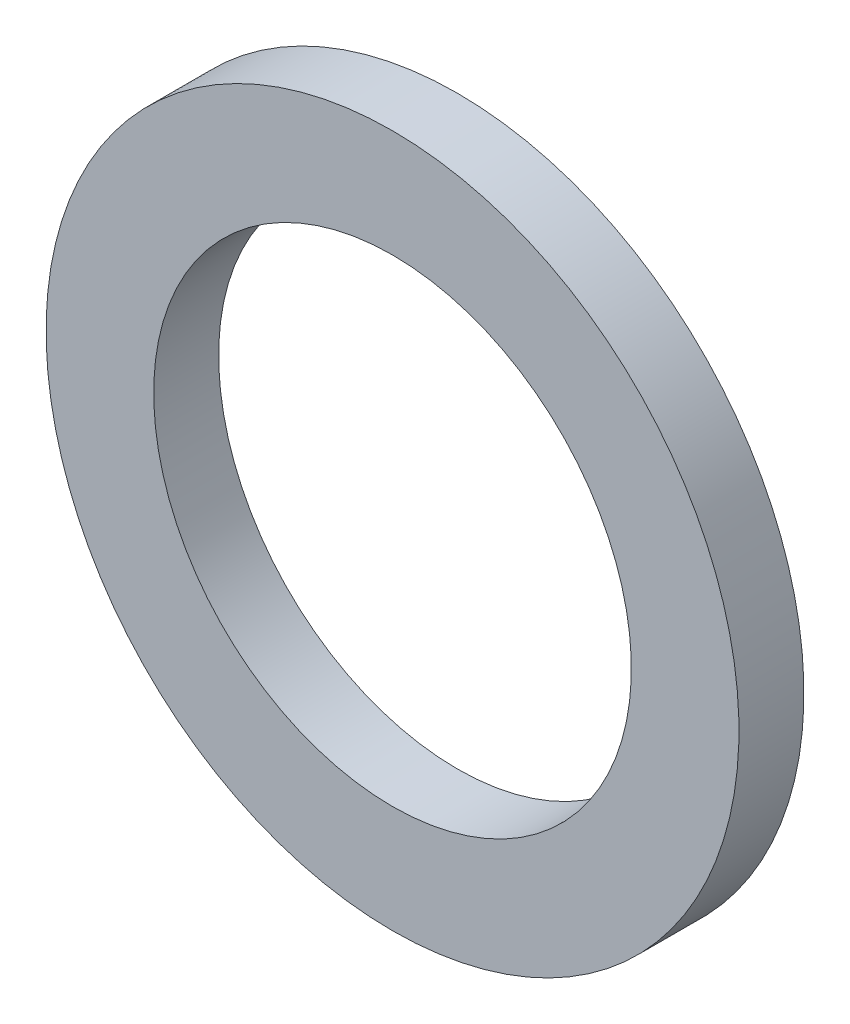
ISO-10303-21;
HEADER;
FILE_DESCRIPTION(('STEP AP214'),'2;1');
FILE_NAME('part.step','',(''),(''),'','','');
FILE_SCHEMA(('AUTOMOTIVE_DESIGN { 1 0 10303 214 1 1 1 1 }'));
ENDSEC;
DATA;
#1=APPLICATION_CONTEXT('core data for automotive mechanical design processes');
#2=APPLICATION_PROTOCOL_DEFINITION('international standard','automotive_design',2000,#1);
#3=PRODUCT_CONTEXT('',#1,'mechanical');
#4=PRODUCT('Part','Part','',(#3));
#5=PRODUCT_RELATED_PRODUCT_CATEGORY('part','',(#4));
#6=PRODUCT_DEFINITION_FORMATION('','',#4);
#7=PRODUCT_DEFINITION_CONTEXT('part definition',#1,'design');
#8=PRODUCT_DEFINITION('design','',#6,#7);
#9=PRODUCT_DEFINITION_SHAPE('','',#8);
#10=(LENGTH_UNIT() NAMED_UNIT(*) SI_UNIT(.MILLI.,.METRE.));
#11=(NAMED_UNIT(*) PLANE_ANGLE_UNIT() SI_UNIT($,.RADIAN.));
#12=(NAMED_UNIT(*) SI_UNIT($,.STERADIAN.) SOLID_ANGLE_UNIT());
#13=UNCERTAINTY_MEASURE_WITH_UNIT(LENGTH_MEASURE(1.E-05),#10,'distance_accuracy_value','');
#14=(GEOMETRIC_REPRESENTATION_CONTEXT(3) GLOBAL_UNCERTAINTY_ASSIGNED_CONTEXT((#13)) GLOBAL_UNIT_ASSIGNED_CONTEXT((#10,
#11,#12)) REPRESENTATION_CONTEXT('',''));
#15=CARTESIAN_POINT('',(0.,0.,0.));
#16=DIRECTION('',(0.,0.,1.));
#17=DIRECTION('',(1.,0.,0.));
#18=AXIS2_PLACEMENT_3D('',#15,#16,#17);
#19=CARTESIAN_POINT('',(-45.2,-12.13655,26.625));
#20=DIRECTION('',(0.,0.,1.));
#21=DIRECTION('',(0.,-1.,0.));
#22=AXIS2_PLACEMENT_3D('',#19,#20,#21);
#23=PLANE('',#22);
#24=CARTESIAN_POINT('',(-45.2,-8.,26.625));
#25=DIRECTION('',(0.,0.,1.));
#26=DIRECTION('',(0.,-1.,0.));
#27=AXIS2_PLACEMENT_3D('',#24,#25,#26);
#28=CIRCLE('',#27,4.13655);
#29=CARTESIAN_POINT('',(-45.2,-12.13655,26.625));
#30=VERTEX_POINT('',#29);
#31=EDGE_CURVE('E27',#30,#30,#28,.F.);
#32=ORIENTED_EDGE('',*,*,#31,.T.);
#33=EDGE_LOOP('',(#32));
#34=FACE_BOUND('',#33,.T.);
#35=CARTESIAN_POINT('',(-45.2,-8.,26.625));
#36=DIRECTION('',(0.,0.,1.));
#37=DIRECTION('',(0.,-1.,0.));
#38=AXIS2_PLACEMENT_3D('',#35,#36,#37);
#39=CIRCLE('',#38,6.);
#40=CARTESIAN_POINT('',(-45.2,-14.,26.625));
#41=VERTEX_POINT('',#40);
#42=EDGE_CURVE('E18',#41,#41,#39,.F.);
#43=ORIENTED_EDGE('',*,*,#42,.F.);
#44=EDGE_LOOP('',(#43));
#45=FACE_BOUND('',#44,.T.);
#46=ADVANCED_FACE('F15',(#34,#45),#23,.T.);
#47=CARTESIAN_POINT('',(-45.2,-8.,30.));
#48=DIRECTION('',(0.,0.,1.));
#49=DIRECTION('',(0.,-1.,0.));
#50=AXIS2_PLACEMENT_3D('',#47,#48,#49);
#51=CYLINDRICAL_SURFACE('',#50,6.);
#52=ORIENTED_EDGE('',*,*,#42,.T.);
#53=EDGE_LOOP('',(#52));
#54=FACE_BOUND('',#53,.T.);
#55=CARTESIAN_POINT('',(-45.2,-8.,25.5));
#56=DIRECTION('',(0.,0.,1.));
#57=DIRECTION('',(0.,-1.,0.));
#58=AXIS2_PLACEMENT_3D('',#55,#56,#57);
#59=CIRCLE('',#58,6.);
#60=CARTESIAN_POINT('',(-45.2,-14.,25.5));
#61=VERTEX_POINT('',#60);
#62=EDGE_CURVE('E22',#61,#61,#59,.F.);
#63=ORIENTED_EDGE('',*,*,#62,.F.);
#64=EDGE_LOOP('',(#63));
#65=FACE_BOUND('',#64,.T.);
#66=ADVANCED_FACE('F35',(#54,#65),#51,.T.);
#67=CARTESIAN_POINT('',(-45.2,-8.,30.));
#68=DIRECTION('',(0.,0.,1.));
#69=DIRECTION('',(0.,-1.,0.));
#70=AXIS2_PLACEMENT_3D('',#67,#68,#69);
#71=CYLINDRICAL_SURFACE('',#70,4.13655);
#72=CARTESIAN_POINT('',(-45.2,-8.,25.5));
#73=DIRECTION('',(0.,0.,1.));
#74=DIRECTION('',(0.,-1.,0.));
#75=AXIS2_PLACEMENT_3D('',#72,#73,#74);
#76=CIRCLE('',#75,4.13655);
#77=CARTESIAN_POINT('',(-45.2,-12.13655,25.5));
#78=VERTEX_POINT('',#77);
#79=EDGE_CURVE('E10',#78,#78,#76,.T.);
#80=ORIENTED_EDGE('',*,*,#79,.F.);
#81=EDGE_LOOP('',(#80));
#82=FACE_BOUND('',#81,.T.);
#83=ORIENTED_EDGE('',*,*,#31,.F.);
#84=EDGE_LOOP('',(#83));
#85=FACE_BOUND('',#84,.T.);
#86=ADVANCED_FACE('F43',(#82,#85),#71,.F.);
#87=CARTESIAN_POINT('',(-45.2,-14.,25.5));
#88=DIRECTION('',(0.,0.,-1.));
#89=DIRECTION('',(0.,1.,0.));
#90=AXIS2_PLACEMENT_3D('',#87,#88,#89);
#91=PLANE('',#90);
#92=ORIENTED_EDGE('',*,*,#79,.T.);
#93=EDGE_LOOP('',(#92));
#94=FACE_BOUND('',#93,.T.);
#95=ORIENTED_EDGE('',*,*,#62,.T.);
#96=EDGE_LOOP('',(#95));
#97=FACE_BOUND('',#96,.T.);
#98=ADVANCED_FACE('F44',(#94,#97),#91,.T.);
#99=CLOSED_SHELL('',(#46,#66,#86,#98));
#100=MANIFOLD_SOLID_BREP('B1',#99);
#101=ADVANCED_BREP_SHAPE_REPRESENTATION('',(#18,#100),#14);
#102=SHAPE_DEFINITION_REPRESENTATION(#9,#101);
ENDSEC;
END-ISO-10303-21;
